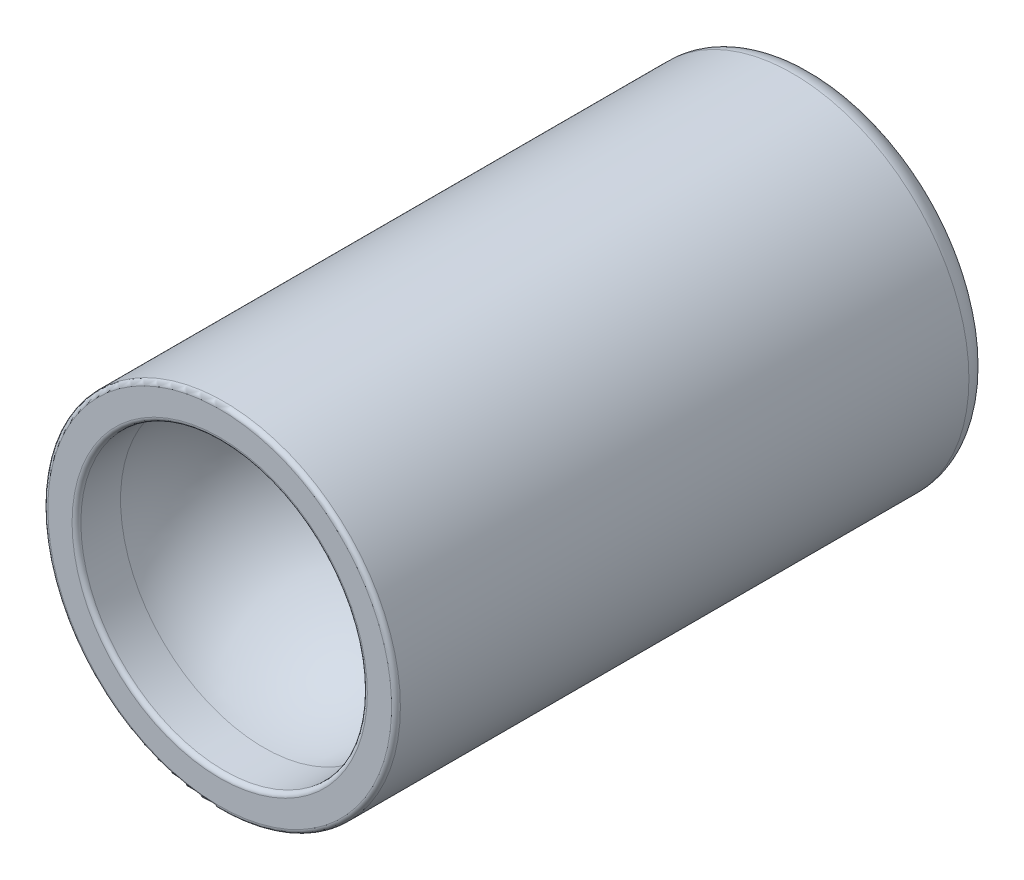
ISO-10303-21;
HEADER;
FILE_DESCRIPTION(('STEP AP214'),'2;1');
FILE_NAME('part.step','',(''),(''),'','','');
FILE_SCHEMA(('AUTOMOTIVE_DESIGN { 1 0 10303 214 1 1 1 1 }'));
ENDSEC;
DATA;
#1=APPLICATION_CONTEXT('core data for automotive mechanical design processes');
#2=APPLICATION_PROTOCOL_DEFINITION('international standard','automotive_design',2000,#1);
#3=PRODUCT_CONTEXT('',#1,'mechanical');
#4=PRODUCT('Part','Part','',(#3));
#5=PRODUCT_RELATED_PRODUCT_CATEGORY('part','',(#4));
#6=PRODUCT_DEFINITION_FORMATION('','',#4);
#7=PRODUCT_DEFINITION_CONTEXT('part definition',#1,'design');
#8=PRODUCT_DEFINITION('design','',#6,#7);
#9=PRODUCT_DEFINITION_SHAPE('','',#8);
#10=(LENGTH_UNIT() NAMED_UNIT(*) SI_UNIT(.MILLI.,.METRE.));
#11=(NAMED_UNIT(*) PLANE_ANGLE_UNIT() SI_UNIT($,.RADIAN.));
#12=(NAMED_UNIT(*) SI_UNIT($,.STERADIAN.) SOLID_ANGLE_UNIT());
#13=UNCERTAINTY_MEASURE_WITH_UNIT(LENGTH_MEASURE(1.E-05),#10,'distance_accuracy_value','');
#14=(GEOMETRIC_REPRESENTATION_CONTEXT(3) GLOBAL_UNCERTAINTY_ASSIGNED_CONTEXT((#13)) GLOBAL_UNIT_ASSIGNED_CONTEXT((#10,
#11,#12)) REPRESENTATION_CONTEXT('',''));
#15=CARTESIAN_POINT('',(0.,0.,0.));
#16=DIRECTION('',(0.,0.,1.));
#17=DIRECTION('',(1.,0.,0.));
#18=AXIS2_PLACEMENT_3D('',#15,#16,#17);
#19=CARTESIAN_POINT('',(0.,8.,0.));
#20=DIRECTION('',(0.,0.,-1.));
#21=DIRECTION('',(-1.,0.,0.));
#22=AXIS2_PLACEMENT_3D('',#19,#20,#21);
#23=PLANE('',#22);
#24=CARTESIAN_POINT('',(0.,0.,0.));
#25=DIRECTION('',(0.,0.,-1.));
#26=DIRECTION('',(-1.,0.,0.));
#27=AXIS2_PLACEMENT_3D('',#24,#25,#26);
#28=CIRCLE('',#27,6.7);
#29=CARTESIAN_POINT('',(-6.7,0.,0.));
#30=VERTEX_POINT('',#29);
#31=EDGE_CURVE('E44',#30,#30,#28,.T.);
#32=ORIENTED_EDGE('',*,*,#31,.T.);
#33=EDGE_LOOP('',(#32));
#34=FACE_BOUND('',#33,.T.);
#35=CARTESIAN_POINT('',(0.,0.,0.));
#36=DIRECTION('',(0.,0.,-1.));
#37=DIRECTION('',(-1.,0.,0.));
#38=AXIS2_PLACEMENT_3D('',#35,#36,#37);
#39=CIRCLE('',#38,7.8);
#40=CARTESIAN_POINT('',(-7.8,0.,0.));
#41=VERTEX_POINT('',#40);
#42=EDGE_CURVE('E47',#41,#41,#39,.F.);
#43=ORIENTED_EDGE('',*,*,#42,.T.);
#44=EDGE_LOOP('',(#43));
#45=FACE_BOUND('',#44,.T.);
#46=ADVANCED_FACE('F25',(#34,#45),#23,.F.);
#47=CARTESIAN_POINT('',(0.,0.,0.));
#48=DIRECTION('',(0.,0.,1.));
#49=DIRECTION('',(1.,0.,0.));
#50=AXIS2_PLACEMENT_3D('',#47,#48,#49);
#51=CYLINDRICAL_SURFACE('',#50,6.5);
#52=CARTESIAN_POINT('',(0.,0.,-0.2));
#53=DIRECTION('',(0.,0.,-1.));
#54=DIRECTION('',(-1.,0.,0.));
#55=AXIS2_PLACEMENT_3D('',#52,#53,#54);
#56=CIRCLE('',#55,6.5);
#57=CARTESIAN_POINT('',(-6.5,0.,-0.2));
#58=VERTEX_POINT('',#57);
#59=EDGE_CURVE('E50',#58,#58,#56,.F.);
#60=ORIENTED_EDGE('',*,*,#59,.T.);
#61=EDGE_LOOP('',(#60));
#62=FACE_BOUND('',#61,.T.);
#63=CARTESIAN_POINT('',(0.,0.,-2.));
#64=DIRECTION('',(0.,0.,1.));
#65=DIRECTION('',(1.,0.,0.));
#66=AXIS2_PLACEMENT_3D('',#63,#64,#65);
#67=CIRCLE('',#66,6.5);
#68=CARTESIAN_POINT('',(6.5,0.,-2.));
#69=VERTEX_POINT('',#68);
#70=EDGE_CURVE('E62',#69,#69,#67,.T.);
#71=ORIENTED_EDGE('',*,*,#70,.F.);
#72=EDGE_LOOP('',(#71));
#73=FACE_BOUND('',#72,.T.);
#74=ADVANCED_FACE('F95',(#62,#73),#51,.F.);
#75=CARTESIAN_POINT('',(0.,0.,-2.));
#76=DIRECTION('',(0.,0.,1.));
#77=DIRECTION('',(0.,1.,0.));
#78=AXIS2_PLACEMENT_3D('',#75,#76,#77);
#79=SPHERICAL_SURFACE('',#78,6.5);
#80=CARTESIAN_POINT('',(0.,0.,-7.57202755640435));
#81=DIRECTION('',(0.,0.,1.));
#82=DIRECTION('',(1.,0.,0.));
#83=AXIS2_PLACEMENT_3D('',#80,#81,#82);
#84=CIRCLE('',#83,3.34701492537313);
#85=CARTESIAN_POINT('',(3.34701492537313,0.,-7.57202755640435));
#86=VERTEX_POINT('',#85);
#87=EDGE_CURVE('E53',#86,#86,#84,.F.);
#88=ORIENTED_EDGE('',*,*,#87,.T.);
#89=EDGE_LOOP('',(#88));
#90=FACE_BOUND('',#89,.T.);
#91=ORIENTED_EDGE('',*,*,#70,.T.);
#92=EDGE_LOOP('',(#91));
#93=FACE_BOUND('',#92,.T.);
#94=ADVANCED_FACE('F100',(#90,#93),#79,.F.);
#95=CARTESIAN_POINT('',(0.,0.,0.));
#96=DIRECTION('',(0.,0.,1.));
#97=DIRECTION('',(1.,0.,0.));
#98=AXIS2_PLACEMENT_3D('',#95,#96,#97);
#99=CYLINDRICAL_SURFACE('',#98,3.25);
#100=CARTESIAN_POINT('',(0.,0.,-7.74347455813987));
#101=DIRECTION('',(0.,0.,1.));
#102=DIRECTION('',(1.,0.,0.));
#103=AXIS2_PLACEMENT_3D('',#100,#101,#102);
#104=CIRCLE('',#103,3.25);
#105=CARTESIAN_POINT('',(3.25,0.,-7.74347455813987));
#106=VERTEX_POINT('',#105);
#107=EDGE_CURVE('E56',#106,#106,#104,.T.);
#108=CARTESIAN_POINT('',(0.,0.,-15.7565254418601));
#109=DIRECTION('',(0.,0.,-1.));
#110=DIRECTION('',(-1.,0.,0.));
#111=AXIS2_PLACEMENT_3D('',#108,#109,#110);
#112=CIRCLE('',#111,3.25);
#113=CARTESIAN_POINT('',(3.25,0.,-15.7565254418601));
#114=VERTEX_POINT('',#113);
#115=EDGE_CURVE('E59',#114,#114,#112,.T.);
#116=CARTESIAN_POINT('',(3.25,0.,-7.74347455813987));
#117=CARTESIAN_POINT('',(3.25,0.,-7.82694383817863));
#118=CARTESIAN_POINT('',(3.25,0.,-7.91041311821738));
#119=CARTESIAN_POINT('',(3.25,0.,-8.07735167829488));
#120=CARTESIAN_POINT('',(3.25,0.,-8.16082095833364));
#121=CARTESIAN_POINT('',(3.25,0.,-8.32775951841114));
#122=CARTESIAN_POINT('',(3.25,0.,-8.41122879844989));
#123=CARTESIAN_POINT('',(3.25,0.,-8.5781673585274));
#124=CARTESIAN_POINT('',(3.25,0.,-8.66163663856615));
#125=CARTESIAN_POINT('',(3.25,0.,-8.82857519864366));
#126=CARTESIAN_POINT('',(3.25,0.,-8.91204447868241));
#127=CARTESIAN_POINT('',(3.25,0.,-9.07898303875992));
#128=CARTESIAN_POINT('',(3.25,0.,-9.16245231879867));
#129=CARTESIAN_POINT('',(3.25,0.,-9.32939087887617));
#130=CARTESIAN_POINT('',(3.25,0.,-9.41286015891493));
#131=CARTESIAN_POINT('',(3.25,0.,-9.57979871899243));
#132=CARTESIAN_POINT('',(3.25,0.,-9.66326799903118));
#133=CARTESIAN_POINT('',(3.25,0.,-9.83020655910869));
#134=CARTESIAN_POINT('',(3.25,0.,-9.91367583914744));
#135=CARTESIAN_POINT('',(3.25,0.,-10.0806143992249));
#136=CARTESIAN_POINT('',(3.25,0.,-10.1640836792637));
#137=CARTESIAN_POINT('',(3.25,0.,-10.3310222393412));
#138=CARTESIAN_POINT('',(3.25,0.,-10.41449151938));
#139=CARTESIAN_POINT('',(3.25,0.,-10.5814300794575));
#140=CARTESIAN_POINT('',(3.25,0.,-10.6648993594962));
#141=CARTESIAN_POINT('',(3.25,0.,-10.8318379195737));
#142=CARTESIAN_POINT('',(3.25,0.,-10.9153071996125));
#143=CARTESIAN_POINT('',(3.25,0.,-11.08224575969));
#144=CARTESIAN_POINT('',(3.25,0.,-11.1657150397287));
#145=CARTESIAN_POINT('',(3.25,0.,-11.3326535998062));
#146=CARTESIAN_POINT('',(3.25,0.,-11.416122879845));
#147=CARTESIAN_POINT('',(3.25,0.,-11.5830614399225));
#148=CARTESIAN_POINT('',(3.25,0.,-11.6665307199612));
#149=CARTESIAN_POINT('',(3.25,0.,-11.8334692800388));
#150=CARTESIAN_POINT('',(3.25,0.,-11.9169385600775));
#151=CARTESIAN_POINT('',(3.25,0.,-12.083877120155));
#152=CARTESIAN_POINT('',(3.25,0.,-12.1673464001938));
#153=CARTESIAN_POINT('',(3.25,0.,-12.3342849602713));
#154=CARTESIAN_POINT('',(3.25,0.,-12.41775424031));
#155=CARTESIAN_POINT('',(3.25,0.,-12.5846928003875));
#156=CARTESIAN_POINT('',(3.25,0.,-12.6681620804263));
#157=CARTESIAN_POINT('',(3.25,0.,-12.8351006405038));
#158=CARTESIAN_POINT('',(3.25,0.,-12.9185699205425));
#159=CARTESIAN_POINT('',(3.25,0.,-13.08550848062));
#160=CARTESIAN_POINT('',(3.25,0.,-13.1689777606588));
#161=CARTESIAN_POINT('',(3.25,0.,-13.3359163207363));
#162=CARTESIAN_POINT('',(3.25,0.,-13.4193856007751));
#163=CARTESIAN_POINT('',(3.25,0.,-13.5863241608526));
#164=CARTESIAN_POINT('',(3.25,0.,-13.6697934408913));
#165=CARTESIAN_POINT('',(3.25,0.,-13.8367320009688));
#166=CARTESIAN_POINT('',(3.25,0.,-13.9202012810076));
#167=CARTESIAN_POINT('',(3.25,0.,-14.0871398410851));
#168=CARTESIAN_POINT('',(3.25,0.,-14.1706091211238));
#169=CARTESIAN_POINT('',(3.25,0.,-14.3375476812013));
#170=CARTESIAN_POINT('',(3.25,0.,-14.4210169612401));
#171=CARTESIAN_POINT('',(3.25,0.,-14.5879555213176));
#172=CARTESIAN_POINT('',(3.25,0.,-14.6714248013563));
#173=CARTESIAN_POINT('',(3.25,0.,-14.8383633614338));
#174=CARTESIAN_POINT('',(3.25,0.,-14.9218326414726));
#175=CARTESIAN_POINT('',(3.25,0.,-15.0887712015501));
#176=CARTESIAN_POINT('',(3.25,0.,-15.1722404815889));
#177=CARTESIAN_POINT('',(3.25,0.,-15.3391790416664));
#178=CARTESIAN_POINT('',(3.25,0.,-15.4226483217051));
#179=CARTESIAN_POINT('',(3.25,0.,-15.5895868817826));
#180=CARTESIAN_POINT('',(3.25,0.,-15.6730561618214));
#181=CARTESIAN_POINT('',(3.25,0.,-15.7565254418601));
#182=B_SPLINE_CURVE_WITH_KNOTS('',3,(#116,#117,#118,#119,#120,#121,#122,#123,#124,#125,#126,
#127,#128,#129,#130,#131,#132,#133,#134,#135,#136,#137,#138,#139,#140,#141,#142,#143,#144,#145,
#146,#147,#148,#149,#150,#151,#152,#153,#154,#155,#156,#157,#158,#159,#160,#161,#162,#163,#164,
#165,#166,#167,#168,#169,#170,#171,#172,#173,#174,#175,#176,#177,#178,#179,#180,#181),
.UNSPECIFIED.,.F.,.F.,(4,2,2,2,2,2,2,2,2,2,2,2,2,2,2,2,2,2,2,2,2,2,2,2,2,2,2,2,2,2,2,2,4),(0.,
0.250407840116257,0.500815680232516,0.751223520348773,1.00163136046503,1.25203920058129,
1.50244704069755,1.75285488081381,2.00326272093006,2.25367056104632,2.50407840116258,
2.75448624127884,3.00489408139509,3.25530192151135,3.50570976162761,3.75611760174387,
4.00652544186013,4.25693328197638,4.50734112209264,4.7577489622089,5.00815680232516,
5.25856464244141,5.50897248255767,5.75938032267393,6.00978816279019,6.26019600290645,
6.51060384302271,6.76101168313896,7.01141952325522,7.26182736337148,7.51223520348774,
7.76264304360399,8.01305088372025),.UNSPECIFIED.);
#183=EDGE_CURVE('BSEAM166',#106,#114,#182,.T.);
#184=ORIENTED_EDGE('',*,*,#107,.T.);
#185=ORIENTED_EDGE('',*,*,#115,.T.);
#186=ORIENTED_EDGE('',*,*,#183,.T.);
#187=ORIENTED_EDGE('',*,*,#183,.F.);
#188=EDGE_LOOP('',(#184,#186,#185,#187));
#189=FACE_BOUND('',#188,.T.);
#190=ADVANCED_FACE('F166',(#189),#99,.F.);
#191=CARTESIAN_POINT('',(0.,0.,-21.5));
#192=DIRECTION('',(0.,0.,1.));
#193=DIRECTION('',(0.,1.,0.));
#194=AXIS2_PLACEMENT_3D('',#191,#192,#193);
#195=SPHERICAL_SURFACE('',#194,6.5);
#196=CARTESIAN_POINT('',(0.,0.,-15.9279724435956));
#197=DIRECTION('',(0.,0.,-1.));
#198=DIRECTION('',(-1.,0.,0.));
#199=AXIS2_PLACEMENT_3D('',#196,#197,#198);
#200=CIRCLE('',#199,3.34701492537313);
#201=CARTESIAN_POINT('',(-3.34701492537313,0.,-15.9279724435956));
#202=VERTEX_POINT('',#201);
#203=EDGE_CURVE('E39',#202,#202,#200,.F.);
#204=ORIENTED_EDGE('',*,*,#203,.T.);
#205=EDGE_LOOP('',(#204));
#206=FACE_BOUND('',#205,.T.);
#207=CARTESIAN_POINT('',(0.,0.,-21.5));
#208=DIRECTION('',(0.,0.,1.));
#209=DIRECTION('',(1.,0.,0.));
#210=AXIS2_PLACEMENT_3D('',#207,#208,#209);
#211=CIRCLE('',#210,6.5);
#212=CARTESIAN_POINT('',(6.5,0.,-21.5));
#213=VERTEX_POINT('',#212);
#214=EDGE_CURVE('E65',#213,#213,#211,.T.);
#215=ORIENTED_EDGE('',*,*,#214,.F.);
#216=EDGE_LOOP('',(#215));
#217=FACE_BOUND('',#216,.T.);
#218=ADVANCED_FACE('F92',(#206,#217),#195,.F.);
#219=CARTESIAN_POINT('',(0.,0.,0.));
#220=DIRECTION('',(0.,0.,1.));
#221=DIRECTION('',(1.,0.,0.));
#222=AXIS2_PLACEMENT_3D('',#219,#220,#221);
#223=CYLINDRICAL_SURFACE('',#222,6.5);
#224=CARTESIAN_POINT('',(0.,0.,-26.8));
#225=DIRECTION('',(0.,0.,1.));
#226=DIRECTION('',(1.,0.,0.));
#227=AXIS2_PLACEMENT_3D('',#224,#225,#226);
#228=CIRCLE('',#227,6.5);
#229=CARTESIAN_POINT('',(6.5,0.,-26.8));
#230=VERTEX_POINT('',#229);
#231=EDGE_CURVE('E31',#230,#230,#228,.F.);
#232=ORIENTED_EDGE('',*,*,#231,.T.);
#233=EDGE_LOOP('',(#232));
#234=FACE_BOUND('',#233,.T.);
#235=ORIENTED_EDGE('',*,*,#214,.T.);
#236=EDGE_LOOP('',(#235));
#237=FACE_BOUND('',#236,.T.);
#238=ADVANCED_FACE('F85',(#234,#237),#223,.F.);
#239=CARTESIAN_POINT('',(0.,6.99999999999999,-27.));
#240=DIRECTION('',(0.,0.,1.));
#241=DIRECTION('',(1.,0.,0.));
#242=AXIS2_PLACEMENT_3D('',#239,#240,#241);
#243=PLANE('',#242);
#244=CARTESIAN_POINT('',(0.,0.,-27.));
#245=DIRECTION('',(0.,0.,1.));
#246=DIRECTION('',(1.,0.,0.));
#247=AXIS2_PLACEMENT_3D('',#244,#245,#246);
#248=CIRCLE('',#247,6.7);
#249=CARTESIAN_POINT('',(6.7,0.,-27.));
#250=VERTEX_POINT('',#249);
#251=EDGE_CURVE('E35',#250,#250,#248,.T.);
#252=ORIENTED_EDGE('',*,*,#251,.T.);
#253=EDGE_LOOP('',(#252));
#254=FACE_BOUND('',#253,.T.);
#255=CARTESIAN_POINT('',(0.,0.,-27.));
#256=DIRECTION('',(0.,0.,1.));
#257=DIRECTION('',(1.,0.,0.));
#258=AXIS2_PLACEMENT_3D('',#255,#256,#257);
#259=CIRCLE('',#258,6.99999999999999);
#260=CARTESIAN_POINT('',(6.99999999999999,0.,-27.));
#261=VERTEX_POINT('',#260);
#262=EDGE_CURVE('E68',#261,#261,#259,.T.);
#263=ORIENTED_EDGE('',*,*,#262,.F.);
#264=EDGE_LOOP('',(#263));
#265=FACE_BOUND('',#264,.T.);
#266=ADVANCED_FACE('F80',(#254,#265),#243,.F.);
#267=CARTESIAN_POINT('',(0.,0.,-26.));
#268=DIRECTION('',(0.,0.,1.));
#269=DIRECTION('',(1.,0.,0.));
#270=AXIS2_PLACEMENT_3D('',#267,#268,#269);
#271=TOROIDAL_SURFACE('',#270,7.,1.);
#272=CARTESIAN_POINT('',(0.,0.,-26.));
#273=DIRECTION('',(0.,0.,1.));
#274=DIRECTION('',(1.,0.,0.));
#275=AXIS2_PLACEMENT_3D('',#272,#273,#274);
#276=CIRCLE('',#275,8.);
#277=CARTESIAN_POINT('',(8.,0.,-26.));
#278=VERTEX_POINT('',#277);
#279=EDGE_CURVE('E71',#278,#278,#276,.T.);
#280=ORIENTED_EDGE('',*,*,#279,.F.);
#281=EDGE_LOOP('',(#280));
#282=FACE_BOUND('',#281,.T.);
#283=ORIENTED_EDGE('',*,*,#262,.T.);
#284=EDGE_LOOP('',(#283));
#285=FACE_BOUND('',#284,.T.);
#286=ADVANCED_FACE('F77',(#282,#285),#271,.T.);
#287=CARTESIAN_POINT('',(0.,0.,0.));
#288=DIRECTION('',(0.,0.,1.));
#289=DIRECTION('',(1.,0.,0.));
#290=AXIS2_PLACEMENT_3D('',#287,#288,#289);
#291=CYLINDRICAL_SURFACE('',#290,8.);
#292=CARTESIAN_POINT('',(0.,0.,-0.2));
#293=DIRECTION('',(0.,0.,-1.));
#294=DIRECTION('',(-1.,0.,0.));
#295=AXIS2_PLACEMENT_3D('',#292,#293,#294);
#296=CIRCLE('',#295,8.);
#297=CARTESIAN_POINT('',(-8.,0.,-0.2));
#298=VERTEX_POINT('',#297);
#299=EDGE_CURVE('E10',#298,#298,#296,.T.);
#300=ORIENTED_EDGE('',*,*,#299,.T.);
#301=EDGE_LOOP('',(#300));
#302=FACE_BOUND('',#301,.T.);
#303=ORIENTED_EDGE('',*,*,#279,.T.);
#304=EDGE_LOOP('',(#303));
#305=FACE_BOUND('',#304,.T.);
#306=ADVANCED_FACE('F75',(#302,#305),#291,.T.);
#307=CARTESIAN_POINT('',(0.,0.,-7.74347455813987));
#308=DIRECTION('',(0.,0.,1.));
#309=DIRECTION('',(1.,0.,0.));
#310=AXIS2_PLACEMENT_3D('',#307,#308,#309);
#311=TOROIDAL_SURFACE('',#310,3.45,0.2);
#312=ORIENTED_EDGE('',*,*,#87,.F.);
#313=EDGE_LOOP('',(#312));
#314=FACE_BOUND('',#313,.T.);
#315=ORIENTED_EDGE('',*,*,#107,.F.);
#316=EDGE_LOOP('',(#315));
#317=FACE_BOUND('',#316,.T.);
#318=ADVANCED_FACE('F124',(#314,#317),#311,.T.);
#319=CARTESIAN_POINT('',(0.,0.,-0.2));
#320=DIRECTION('',(0.,0.,-1.));
#321=DIRECTION('',(-1.,0.,0.));
#322=AXIS2_PLACEMENT_3D('',#319,#320,#321);
#323=TOROIDAL_SURFACE('',#322,6.7,0.2);
#324=ORIENTED_EDGE('',*,*,#31,.F.);
#325=EDGE_LOOP('',(#324));
#326=FACE_BOUND('',#325,.T.);
#327=ORIENTED_EDGE('',*,*,#59,.F.);
#328=EDGE_LOOP('',(#327));
#329=FACE_BOUND('',#328,.T.);
#330=ADVANCED_FACE('F120',(#326,#329),#323,.T.);
#331=CARTESIAN_POINT('',(0.,0.,-15.7565254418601));
#332=DIRECTION('',(0.,0.,-1.));
#333=DIRECTION('',(-1.,0.,0.));
#334=AXIS2_PLACEMENT_3D('',#331,#332,#333);
#335=TOROIDAL_SURFACE('',#334,3.45,0.2);
#336=ORIENTED_EDGE('',*,*,#115,.F.);
#337=EDGE_LOOP('',(#336));
#338=FACE_BOUND('',#337,.T.);
#339=ORIENTED_EDGE('',*,*,#203,.F.);
#340=EDGE_LOOP('',(#339));
#341=FACE_BOUND('',#340,.T.);
#342=ADVANCED_FACE('F114',(#338,#341),#335,.T.);
#343=CARTESIAN_POINT('',(0.,0.,-26.8));
#344=DIRECTION('',(0.,0.,1.));
#345=DIRECTION('',(1.,0.,0.));
#346=AXIS2_PLACEMENT_3D('',#343,#344,#345);
#347=TOROIDAL_SURFACE('',#346,6.7,0.2);
#348=ORIENTED_EDGE('',*,*,#231,.F.);
#349=EDGE_LOOP('',(#348));
#350=FACE_BOUND('',#349,.T.);
#351=ORIENTED_EDGE('',*,*,#251,.F.);
#352=EDGE_LOOP('',(#351));
#353=FACE_BOUND('',#352,.T.);
#354=ADVANCED_FACE('F108',(#350,#353),#347,.T.);
#355=CARTESIAN_POINT('',(0.,0.,-0.2));
#356=DIRECTION('',(0.,0.,-1.));
#357=DIRECTION('',(-1.,0.,0.));
#358=AXIS2_PLACEMENT_3D('',#355,#356,#357);
#359=TOROIDAL_SURFACE('',#358,7.8,0.2);
#360=ORIENTED_EDGE('',*,*,#299,.F.);
#361=EDGE_LOOP('',(#360));
#362=FACE_BOUND('',#361,.T.);
#363=ORIENTED_EDGE('',*,*,#42,.F.);
#364=EDGE_LOOP('',(#363));
#365=FACE_BOUND('',#364,.T.);
#366=ADVANCED_FACE('F106',(#362,#365),#359,.T.);
#367=CLOSED_SHELL('',(#46,#74,#94,#190,#218,#238,#266,#286,#306,#318,#330,#342,#354,#366));
#368=MANIFOLD_SOLID_BREP('B2',#367);
#369=ADVANCED_BREP_SHAPE_REPRESENTATION('',(#18,#368),#14);
#370=SHAPE_DEFINITION_REPRESENTATION(#9,#369);
ENDSEC;
END-ISO-10303-21;
